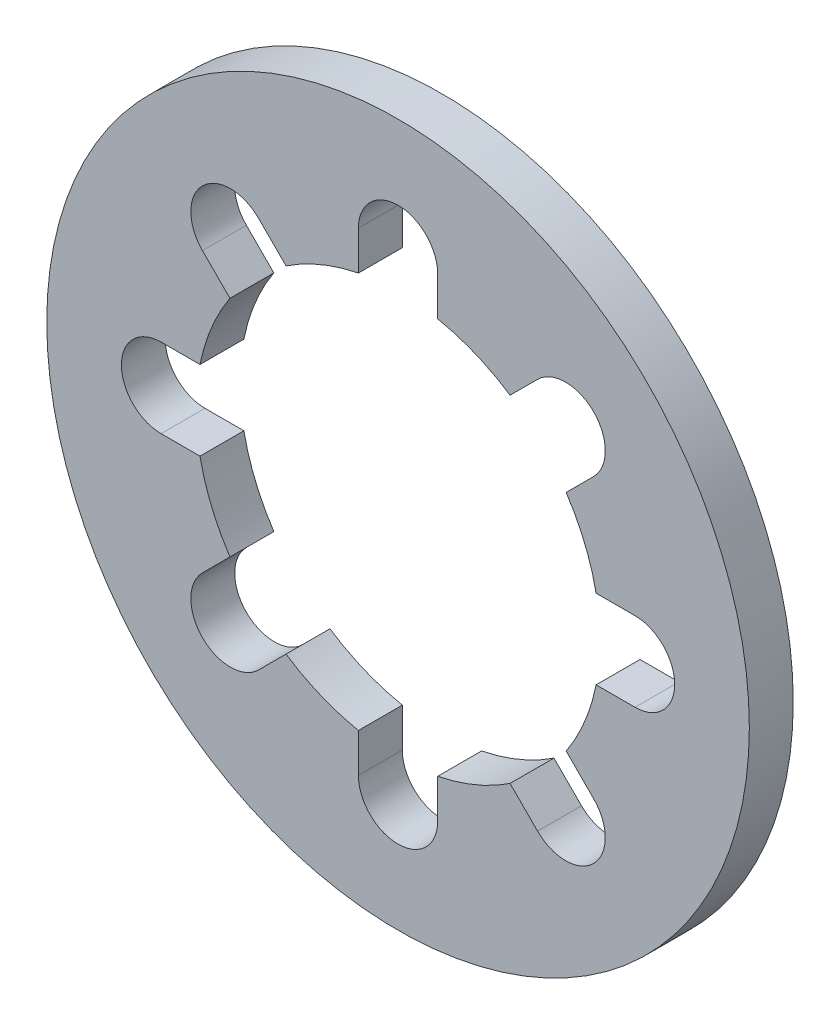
from build123d import *

# Parameters (mm, degrees)
SKETCH1_R          = 4
SKETCH1_R_2        = 2.3
BASE_EXTRUDE_DEPTH = 0.5
TYPEBSLOT_DEPTH    = 10.430473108
TYPEBPATTERN_COUNT = 8


with BuildPart() as part:
    # Sketch1 → Base-Extrude (new body)
    with BuildSketch(Plane.XY):
        Circle(SKETCH1_R)
        Circle(SKETCH1_R_2, mode=Mode.SUBTRACT)
    extrude(amount=-BASE_EXTRUDE_DEPTH)

    # Sketch2 → TypeBSlot (cut, through all)
    with BuildSketch(Plane(origin=(-2.555442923, 2.760916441, 0), x_dir=(1, 0, 0), z_dir=(0, 0, 1))):
        with BuildLine():
            Line((2.10383936, -0.505688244), (2.10383936, -0.062520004))
            ThreePointArc((2.10383936, -0.062520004), (2.555442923, 0.389083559), (3.007046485, -0.062520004))
            Line((3.007046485, -0.062520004), (3.007046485, -0.505688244))
            Line((3.007046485, -0.505688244), (2.10383936, -0.505688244))
        make_face()
    typebslot = extrude(amount=-TYPEBSLOT_DEPTH, mode=Mode.SUBTRACT)

    # TypeBPattern: TypeBSlot ×8 about axis
    typebpattern_axis = Axis((0, 0, 0), (0, 0, 1))
    for i in range(1, TYPEBPATTERN_COUNT):
        add(typebslot.rotate(typebpattern_axis, i * 360 / TYPEBPATTERN_COUNT), mode=Mode.SUBTRACT)


solid = part.part
